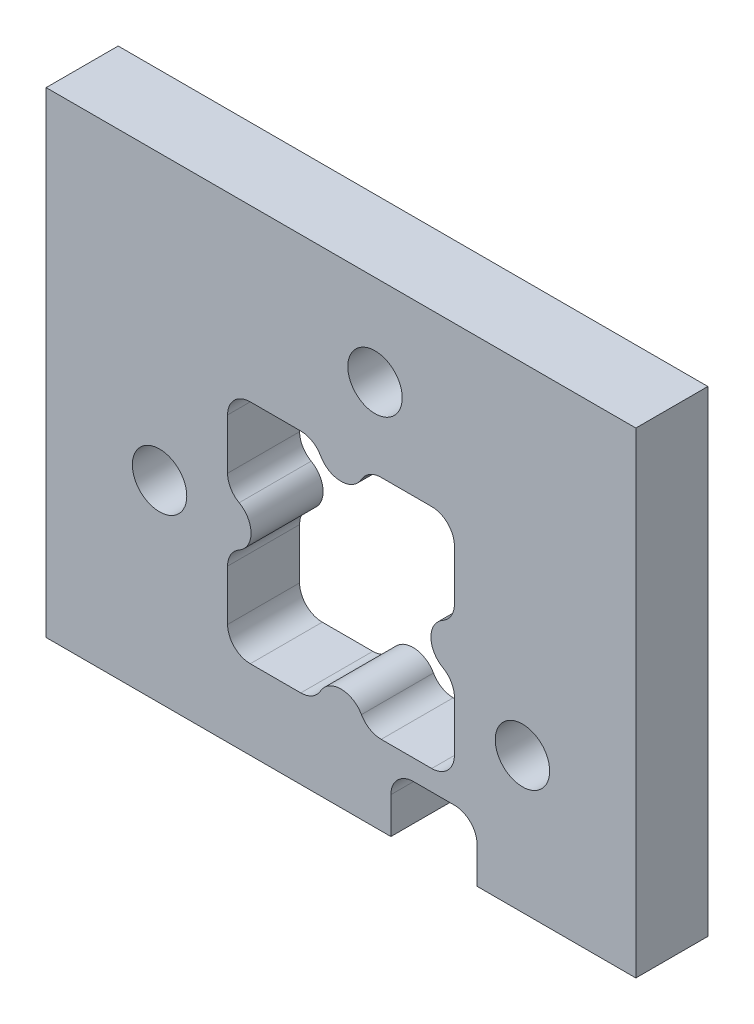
ISO-10303-21;
HEADER;
FILE_DESCRIPTION(('STEP AP214'),'2;1');
FILE_NAME('part.step','',(''),(''),'','','');
FILE_SCHEMA(('AUTOMOTIVE_DESIGN { 1 0 10303 214 1 1 1 1 }'));
ENDSEC;
DATA;
#1=APPLICATION_CONTEXT('core data for automotive mechanical design processes');
#2=APPLICATION_PROTOCOL_DEFINITION('international standard','automotive_design',2000,#1);
#3=PRODUCT_CONTEXT('',#1,'mechanical');
#4=PRODUCT('Part','Part','',(#3));
#5=PRODUCT_RELATED_PRODUCT_CATEGORY('part','',(#4));
#6=PRODUCT_DEFINITION_FORMATION('','',#4);
#7=PRODUCT_DEFINITION_CONTEXT('part definition',#1,'design');
#8=PRODUCT_DEFINITION('design','',#6,#7);
#9=PRODUCT_DEFINITION_SHAPE('','',#8);
#10=(LENGTH_UNIT() NAMED_UNIT(*) SI_UNIT(.MILLI.,.METRE.));
#11=(NAMED_UNIT(*) PLANE_ANGLE_UNIT() SI_UNIT($,.RADIAN.));
#12=(NAMED_UNIT(*) SI_UNIT($,.STERADIAN.) SOLID_ANGLE_UNIT());
#13=UNCERTAINTY_MEASURE_WITH_UNIT(LENGTH_MEASURE(1.E-05),#10,'distance_accuracy_value','');
#14=(GEOMETRIC_REPRESENTATION_CONTEXT(3) GLOBAL_UNCERTAINTY_ASSIGNED_CONTEXT((#13)) GLOBAL_UNIT_ASSIGNED_CONTEXT((#10,
#11,#12)) REPRESENTATION_CONTEXT('',''));
#15=CARTESIAN_POINT('',(0.,0.,0.));
#16=DIRECTION('',(0.,0.,1.));
#17=DIRECTION('',(1.,0.,0.));
#18=AXIS2_PLACEMENT_3D('',#15,#16,#17);
#19=CARTESIAN_POINT('',(-13.783981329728,8.2438596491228,3.175));
#20=DIRECTION('',(1.,0.,0.));
#21=DIRECTION('',(0.,0.,-1.));
#22=AXIS2_PLACEMENT_3D('',#19,#20,#21);
#23=PLANE('',#22);
#24=DIRECTION('',(0.,-1.,0.));
#25=VECTOR('',#24,1.);
#26=CARTESIAN_POINT('',(-13.783981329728,8.2438596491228,0.));
#27=LINE('',#26,#25);
#28=CARTESIAN_POINT('',(-13.783981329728,8.2438596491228,0.));
#29=VERTEX_POINT('',#28);
#30=CARTESIAN_POINT('',(-13.783981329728,-12.7561403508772,0.));
#31=VERTEX_POINT('',#30);
#32=EDGE_CURVE('E276',#29,#31,#27,.T.);
#33=ORIENTED_EDGE('',*,*,#32,.T.);
#34=DIRECTION('',(0.,0.,-1.));
#35=VECTOR('',#34,1.);
#36=CARTESIAN_POINT('',(-13.783981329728,-12.7561403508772,3.175));
#37=LINE('',#36,#35);
#38=CARTESIAN_POINT('',(-13.783981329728,-12.7561403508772,3.175));
#39=VERTEX_POINT('',#38);
#40=EDGE_CURVE('E258',#39,#31,#37,.T.);
#41=ORIENTED_EDGE('',*,*,#40,.F.);
#42=DIRECTION('',(0.,-1.,0.));
#43=VECTOR('',#42,1.);
#44=CARTESIAN_POINT('',(-13.783981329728,8.2438596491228,3.175));
#45=LINE('',#44,#43);
#46=CARTESIAN_POINT('',(-13.783981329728,8.2438596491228,3.175));
#47=VERTEX_POINT('',#46);
#48=EDGE_CURVE('E264',#47,#39,#45,.T.);
#49=ORIENTED_EDGE('',*,*,#48,.F.);
#50=DIRECTION('',(0.,0.,-1.));
#51=VECTOR('',#50,1.);
#52=CARTESIAN_POINT('',(-13.783981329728,8.2438596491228,3.175));
#53=LINE('',#52,#51);
#54=EDGE_CURVE('E440',#47,#29,#53,.T.);
#55=ORIENTED_EDGE('',*,*,#54,.T.);
#56=EDGE_LOOP('',(#33,#41,#49,#55));
#57=FACE_BOUND('',#56,.T.);
#58=ADVANCED_FACE('F33',(#57),#23,.F.);
#59=CARTESIAN_POINT('',(-13.783981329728,-12.7561403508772,3.175));
#60=DIRECTION('',(0.,1.,0.));
#61=DIRECTION('',(-1.,0.,0.));
#62=AXIS2_PLACEMENT_3D('',#59,#60,#61);
#63=PLANE('',#62);
#64=DIRECTION('',(1.,0.,0.));
#65=VECTOR('',#64,1.);
#66=CARTESIAN_POINT('',(-13.783981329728,-12.7561403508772,0.));
#67=LINE('',#66,#65);
#68=CARTESIAN_POINT('',(1.41601867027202,-12.7561403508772,0.));
#69=VERTEX_POINT('',#68);
#70=EDGE_CURVE('E432',#31,#69,#67,.T.);
#71=ORIENTED_EDGE('',*,*,#70,.T.);
#72=DIRECTION('',(0.,0.,-1.));
#73=VECTOR('',#72,1.);
#74=CARTESIAN_POINT('',(1.41601867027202,-12.7561403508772,3.175));
#75=LINE('',#74,#73);
#76=CARTESIAN_POINT('',(1.41601867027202,-12.7561403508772,3.175));
#77=VERTEX_POINT('',#76);
#78=EDGE_CURVE('E261',#77,#69,#75,.T.);
#79=ORIENTED_EDGE('',*,*,#78,.F.);
#80=DIRECTION('',(1.,0.,0.));
#81=VECTOR('',#80,1.);
#82=CARTESIAN_POINT('',(-13.783981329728,-12.7561403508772,3.175));
#83=LINE('',#82,#81);
#84=EDGE_CURVE('E254',#39,#77,#83,.T.);
#85=ORIENTED_EDGE('',*,*,#84,.F.);
#86=ORIENTED_EDGE('',*,*,#40,.T.);
#87=EDGE_LOOP('',(#71,#79,#85,#86));
#88=FACE_BOUND('',#87,.T.);
#89=ADVANCED_FACE('F256',(#88),#63,.F.);
#90=CARTESIAN_POINT('',(1.41601867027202,-12.7561403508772,3.175));
#91=DIRECTION('',(-1.,0.,0.));
#92=DIRECTION('',(0.,0.,1.));
#93=AXIS2_PLACEMENT_3D('',#90,#91,#92);
#94=PLANE('',#93);
#95=DIRECTION('',(0.,1.,0.));
#96=VECTOR('',#95,1.);
#97=CARTESIAN_POINT('',(1.41601867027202,-12.7561403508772,0.));
#98=LINE('',#97,#96);
#99=CARTESIAN_POINT('',(1.41601867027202,-11.1561403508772,0.));
#100=VERTEX_POINT('',#99);
#101=EDGE_CURVE('E428',#69,#100,#98,.T.);
#102=ORIENTED_EDGE('',*,*,#101,.T.);
#103=DIRECTION('',(0.,0.,-1.));
#104=VECTOR('',#103,1.);
#105=CARTESIAN_POINT('',(1.41601867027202,-11.1561403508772,3.175));
#106=LINE('',#105,#104);
#107=CARTESIAN_POINT('',(1.41601867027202,-11.1561403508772,3.175));
#108=VERTEX_POINT('',#107);
#109=EDGE_CURVE('E48',#100,#108,#106,.F.);
#110=ORIENTED_EDGE('',*,*,#109,.T.);
#111=DIRECTION('',(0.,1.,0.));
#112=VECTOR('',#111,1.);
#113=CARTESIAN_POINT('',(1.41601867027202,-12.7561403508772,3.175));
#114=LINE('',#113,#112);
#115=EDGE_CURVE('E263',#77,#108,#114,.T.);
#116=ORIENTED_EDGE('',*,*,#115,.F.);
#117=ORIENTED_EDGE('',*,*,#78,.T.);
#118=EDGE_LOOP('',(#102,#110,#116,#117));
#119=FACE_BOUND('',#118,.T.);
#120=ADVANCED_FACE('F464',(#119),#94,.F.);
#121=CARTESIAN_POINT('',(1.41601867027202,-10.1561403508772,3.175));
#122=DIRECTION('',(0.,1.,0.));
#123=DIRECTION('',(0.,0.,1.));
#124=AXIS2_PLACEMENT_3D('',#121,#122,#123);
#125=PLANE('',#124);
#126=DIRECTION('',(1.,0.,0.));
#127=VECTOR('',#126,1.);
#128=CARTESIAN_POINT('',(1.41601867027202,-10.1561403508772,0.));
#129=LINE('',#128,#127);
#130=CARTESIAN_POINT('',(2.41601867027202,-10.1561403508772,0.));
#131=VERTEX_POINT('',#130);
#132=CARTESIAN_POINT('',(4.21601867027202,-10.1561403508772,0.));
#133=VERTEX_POINT('',#132);
#134=EDGE_CURVE('E422',#131,#133,#129,.T.);
#135=ORIENTED_EDGE('',*,*,#134,.T.);
#136=DIRECTION('',(0.,0.,-1.));
#137=VECTOR('',#136,1.);
#138=CARTESIAN_POINT('',(4.21601867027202,-10.1561403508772,3.175));
#139=LINE('',#138,#137);
#140=CARTESIAN_POINT('',(4.21601867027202,-10.1561403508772,3.175));
#141=VERTEX_POINT('',#140);
#142=EDGE_CURVE('E396',#133,#141,#139,.F.);
#143=ORIENTED_EDGE('',*,*,#142,.T.);
#144=DIRECTION('',(1.,0.,0.));
#145=VECTOR('',#144,1.);
#146=CARTESIAN_POINT('',(1.41601867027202,-10.1561403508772,3.175));
#147=LINE('',#146,#145);
#148=CARTESIAN_POINT('',(2.41601867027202,-10.1561403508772,3.175));
#149=VERTEX_POINT('',#148);
#150=EDGE_CURVE('E408',#149,#141,#147,.T.);
#151=ORIENTED_EDGE('',*,*,#150,.F.);
#152=DIRECTION('',(0.,0.,-1.));
#153=VECTOR('',#152,1.);
#154=CARTESIAN_POINT('',(2.41601867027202,-10.1561403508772,0.));
#155=LINE('',#154,#153);
#156=EDGE_CURVE('E393',#149,#131,#155,.T.);
#157=ORIENTED_EDGE('',*,*,#156,.T.);
#158=EDGE_LOOP('',(#135,#143,#151,#157));
#159=FACE_BOUND('',#158,.T.);
#160=ADVANCED_FACE('F426',(#159),#125,.F.);
#161=CARTESIAN_POINT('',(5.21601867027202,-10.1561403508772,3.175));
#162=DIRECTION('',(1.,0.,0.));
#163=DIRECTION('',(0.,0.,-1.));
#164=AXIS2_PLACEMENT_3D('',#161,#162,#163);
#165=PLANE('',#164);
#166=DIRECTION('',(0.,-1.,0.));
#167=VECTOR('',#166,1.);
#168=CARTESIAN_POINT('',(5.21601867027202,-10.1561403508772,3.175));
#169=LINE('',#168,#167);
#170=CARTESIAN_POINT('',(5.21601867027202,-11.1561403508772,3.175));
#171=VERTEX_POINT('',#170);
#172=CARTESIAN_POINT('',(5.21601867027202,-12.7561403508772,3.175));
#173=VERTEX_POINT('',#172);
#174=EDGE_CURVE('E405',#171,#173,#169,.T.);
#175=ORIENTED_EDGE('',*,*,#174,.F.);
#176=DIRECTION('',(0.,0.,-1.));
#177=VECTOR('',#176,1.);
#178=CARTESIAN_POINT('',(5.21601867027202,-11.1561403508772,0.));
#179=LINE('',#178,#177);
#180=CARTESIAN_POINT('',(5.21601867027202,-11.1561403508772,0.));
#181=VERTEX_POINT('',#180);
#182=EDGE_CURVE('E390',#171,#181,#179,.T.);
#183=ORIENTED_EDGE('',*,*,#182,.T.);
#184=DIRECTION('',(0.,-1.,0.));
#185=VECTOR('',#184,1.);
#186=CARTESIAN_POINT('',(5.21601867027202,-10.1561403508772,0.));
#187=LINE('',#186,#185);
#188=CARTESIAN_POINT('',(5.21601867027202,-12.7561403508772,0.));
#189=VERTEX_POINT('',#188);
#190=EDGE_CURVE('E424',#181,#189,#187,.T.);
#191=ORIENTED_EDGE('',*,*,#190,.T.);
#192=DIRECTION('',(0.,0.,-1.));
#193=VECTOR('',#192,1.);
#194=CARTESIAN_POINT('',(5.21601867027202,-12.7561403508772,3.175));
#195=LINE('',#194,#193);
#196=EDGE_CURVE('E281',#173,#189,#195,.T.);
#197=ORIENTED_EDGE('',*,*,#196,.F.);
#198=EDGE_LOOP('',(#175,#183,#191,#197));
#199=FACE_BOUND('',#198,.T.);
#200=ADVANCED_FACE('F413',(#199),#165,.F.);
#201=CARTESIAN_POINT('',(5.21601867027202,-12.7561403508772,3.175));
#202=DIRECTION('',(0.,1.,0.));
#203=DIRECTION('',(0.,0.,1.));
#204=AXIS2_PLACEMENT_3D('',#201,#202,#203);
#205=PLANE('',#204);
#206=DIRECTION('',(1.,0.,0.));
#207=VECTOR('',#206,1.);
#208=CARTESIAN_POINT('',(5.21601867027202,-12.7561403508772,0.));
#209=LINE('',#208,#207);
#210=CARTESIAN_POINT('',(12.216018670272,-12.7561403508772,0.));
#211=VERTEX_POINT('',#210);
#212=EDGE_CURVE('E430',#189,#211,#209,.T.);
#213=ORIENTED_EDGE('',*,*,#212,.T.);
#214=DIRECTION('',(0.,0.,-1.));
#215=VECTOR('',#214,1.);
#216=CARTESIAN_POINT('',(12.216018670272,-12.7561403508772,3.175));
#217=LINE('',#216,#215);
#218=CARTESIAN_POINT('',(12.216018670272,-12.7561403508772,3.175));
#219=VERTEX_POINT('',#218);
#220=EDGE_CURVE('E445',#219,#211,#217,.T.);
#221=ORIENTED_EDGE('',*,*,#220,.F.);
#222=DIRECTION('',(1.,0.,0.));
#223=VECTOR('',#222,1.);
#224=CARTESIAN_POINT('',(5.21601867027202,-12.7561403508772,3.175));
#225=LINE('',#224,#223);
#226=EDGE_CURVE('E417',#173,#219,#225,.T.);
#227=ORIENTED_EDGE('',*,*,#226,.F.);
#228=ORIENTED_EDGE('',*,*,#196,.T.);
#229=EDGE_LOOP('',(#213,#221,#227,#228));
#230=FACE_BOUND('',#229,.T.);
#231=ADVANCED_FACE('F448',(#230),#205,.F.);
#232=CARTESIAN_POINT('',(12.216018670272,8.2438596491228,3.175));
#233=DIRECTION('',(-1.,0.,0.));
#234=DIRECTION('',(0.,-1.,0.));
#235=AXIS2_PLACEMENT_3D('',#232,#233,#234);
#236=PLANE('',#235);
#237=DIRECTION('',(0.,1.,0.));
#238=VECTOR('',#237,1.);
#239=CARTESIAN_POINT('',(12.216018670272,8.2438596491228,0.));
#240=LINE('',#239,#238);
#241=CARTESIAN_POINT('',(12.216018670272,8.2438596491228,0.));
#242=VERTEX_POINT('',#241);
#243=EDGE_CURVE('E437',#211,#242,#240,.T.);
#244=ORIENTED_EDGE('',*,*,#243,.T.);
#245=DIRECTION('',(0.,0.,-1.));
#246=VECTOR('',#245,1.);
#247=CARTESIAN_POINT('',(12.216018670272,8.2438596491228,3.175));
#248=LINE('',#247,#246);
#249=CARTESIAN_POINT('',(12.216018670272,8.2438596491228,3.175));
#250=VERTEX_POINT('',#249);
#251=EDGE_CURVE('E442',#250,#242,#248,.T.);
#252=ORIENTED_EDGE('',*,*,#251,.F.);
#253=DIRECTION('',(0.,1.,0.));
#254=VECTOR('',#253,1.);
#255=CARTESIAN_POINT('',(12.216018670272,8.2438596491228,3.175));
#256=LINE('',#255,#254);
#257=EDGE_CURVE('E458',#219,#250,#256,.T.);
#258=ORIENTED_EDGE('',*,*,#257,.F.);
#259=ORIENTED_EDGE('',*,*,#220,.T.);
#260=EDGE_LOOP('',(#244,#252,#258,#259));
#261=FACE_BOUND('',#260,.T.);
#262=ADVANCED_FACE('F454',(#261),#236,.F.);
#263=CARTESIAN_POINT('',(-13.783981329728,8.2438596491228,3.175));
#264=DIRECTION('',(0.,-1.,0.));
#265=DIRECTION('',(0.,0.,-1.));
#266=AXIS2_PLACEMENT_3D('',#263,#264,#265);
#267=PLANE('',#266);
#268=DIRECTION('',(-1.,0.,0.));
#269=VECTOR('',#268,1.);
#270=CARTESIAN_POINT('',(-13.783981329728,8.2438596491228,0.));
#271=LINE('',#270,#269);
#272=EDGE_CURVE('E273',#242,#29,#271,.T.);
#273=ORIENTED_EDGE('',*,*,#272,.T.);
#274=ORIENTED_EDGE('',*,*,#54,.F.);
#275=DIRECTION('',(-1.,0.,0.));
#276=VECTOR('',#275,1.);
#277=CARTESIAN_POINT('',(-13.783981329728,8.2438596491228,3.175));
#278=LINE('',#277,#276);
#279=EDGE_CURVE('E269',#250,#47,#278,.T.);
#280=ORIENTED_EDGE('',*,*,#279,.F.);
#281=ORIENTED_EDGE('',*,*,#251,.T.);
#282=EDGE_LOOP('',(#273,#274,#280,#281));
#283=FACE_BOUND('',#282,.T.);
#284=ADVANCED_FACE('F457',(#283),#267,.F.);
#285=CARTESIAN_POINT('',(0.,0.,3.175));
#286=DIRECTION('',(0.,0.,1.));
#287=DIRECTION('',(1.,0.,0.));
#288=AXIS2_PLACEMENT_3D('',#285,#286,#287);
#289=PLANE('',#288);
#290=CARTESIAN_POINT('',(-8.78398132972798,-4.2561403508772,3.175));
#291=DIRECTION('',(0.,0.,1.));
#292=DIRECTION('',(1.,0.,0.));
#293=AXIS2_PLACEMENT_3D('',#290,#291,#292);
#294=CIRCLE('',#293,1.2);
#295=CARTESIAN_POINT('',(-7.58398132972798,-4.2561403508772,3.175));
#296=VERTEX_POINT('',#295);
#297=EDGE_CURVE('E553',#296,#296,#294,.T.);
#298=ORIENTED_EDGE('',*,*,#297,.F.);
#299=EDGE_LOOP('',(#298));
#300=FACE_BOUND('',#299,.T.);
#301=CARTESIAN_POINT('',(0.716018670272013,4.2438596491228,3.175));
#302=DIRECTION('',(0.,0.,1.));
#303=DIRECTION('',(1.,0.,0.));
#304=AXIS2_PLACEMENT_3D('',#301,#302,#303);
#305=CIRCLE('',#304,1.2);
#306=CARTESIAN_POINT('',(1.91601867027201,4.2438596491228,3.175));
#307=VERTEX_POINT('',#306);
#308=EDGE_CURVE('E547',#307,#307,#305,.T.);
#309=ORIENTED_EDGE('',*,*,#308,.F.);
#310=EDGE_LOOP('',(#309));
#311=FACE_BOUND('',#310,.T.);
#312=CARTESIAN_POINT('',(7.21601867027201,-6.7561403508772,3.175));
#313=DIRECTION('',(0.,0.,1.));
#314=DIRECTION('',(1.,0.,0.));
#315=AXIS2_PLACEMENT_3D('',#312,#313,#314);
#316=CIRCLE('',#315,1.20000000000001);
#317=CARTESIAN_POINT('',(8.41601867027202,-6.7561403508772,3.175));
#318=VERTEX_POINT('',#317);
#319=EDGE_CURVE('E541',#318,#318,#316,.T.);
#320=ORIENTED_EDGE('',*,*,#319,.F.);
#321=EDGE_LOOP('',(#320));
#322=FACE_BOUND('',#321,.T.);
#323=DIRECTION('',(0.,1.,0.));
#324=VECTOR('',#323,1.);
#325=CARTESIAN_POINT('',(4.21601867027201,0.743859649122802,3.175));
#326=LINE('',#325,#324);
#327=CARTESIAN_POINT('',(4.21601867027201,-2.48317721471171,3.175));
#328=VERTEX_POINT('',#327);
#329=CARTESIAN_POINT('',(4.21601867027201,-0.256140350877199,3.175));
#330=VERTEX_POINT('',#329);
#331=EDGE_CURVE('E503',#328,#330,#326,.T.);
#332=ORIENTED_EDGE('',*,*,#331,.F.);
#333=CARTESIAN_POINT('',(3.21601867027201,-2.4831772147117,3.175));
#334=DIRECTION('',(0.,0.,1.));
#335=DIRECTION('',(1.,0.,0.));
#336=AXIS2_PLACEMENT_3D('',#333,#334,#335);
#337=CIRCLE('',#336,1.);
#338=CARTESIAN_POINT('',(3.70729027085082,-3.35418365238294,3.175));
#339=VERTEX_POINT('',#338);
#340=EDGE_CURVE('E342',#328,#339,#337,.F.);
#341=ORIENTED_EDGE('',*,*,#340,.T.);
#342=CARTESIAN_POINT('',(4.21601867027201,-4.2561403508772,3.175));
#343=DIRECTION('',(0.,0.,-1.));
#344=DIRECTION('',(-1.,0.,0.));
#345=AXIS2_PLACEMENT_3D('',#342,#343,#344);
#346=CIRCLE('',#345,1.03553390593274);
#347=CARTESIAN_POINT('',(3.70729027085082,-5.15809704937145,3.175));
#348=VERTEX_POINT('',#347);
#349=EDGE_CURVE('E469',#348,#339,#346,.T.);
#350=ORIENTED_EDGE('',*,*,#349,.F.);
#351=CARTESIAN_POINT('',(3.21601867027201,-6.02910348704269,3.175));
#352=DIRECTION('',(0.,0.,1.));
#353=DIRECTION('',(1.,0.,0.));
#354=AXIS2_PLACEMENT_3D('',#351,#352,#353);
#355=CIRCLE('',#354,1.);
#356=CARTESIAN_POINT('',(4.21601867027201,-6.02910348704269,3.175));
#357=VERTEX_POINT('',#356);
#358=EDGE_CURVE('E346',#348,#357,#355,.F.);
#359=ORIENTED_EDGE('',*,*,#358,.T.);
#360=DIRECTION('',(0.,1.,0.));
#361=VECTOR('',#360,1.);
#362=CARTESIAN_POINT('',(4.21601867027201,-5.29167425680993,3.175));
#363=LINE('',#362,#361);
#364=CARTESIAN_POINT('',(4.21601867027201,-8.2561403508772,3.175));
#365=VERTEX_POINT('',#364);
#366=EDGE_CURVE('E473',#365,#357,#363,.T.);
#367=ORIENTED_EDGE('',*,*,#366,.F.);
#368=CARTESIAN_POINT('',(3.21601867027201,-8.2561403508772,3.175));
#369=DIRECTION('',(0.,0.,1.));
#370=DIRECTION('',(1.,0.,0.));
#371=AXIS2_PLACEMENT_3D('',#368,#369,#370);
#372=CIRCLE('',#371,1.);
#373=CARTESIAN_POINT('',(3.21601867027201,-9.2561403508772,3.175));
#374=VERTEX_POINT('',#373);
#375=EDGE_CURVE('E350',#365,#374,#372,.F.);
#376=ORIENTED_EDGE('',*,*,#375,.T.);
#377=DIRECTION('',(1.,0.,0.));
#378=VECTOR('',#377,1.);
#379=CARTESIAN_POINT('',(4.21601867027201,-9.2561403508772,3.175));
#380=LINE('',#379,#378);
#381=CARTESIAN_POINT('',(0.98898180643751,-9.2561403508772,3.175));
#382=VERTEX_POINT('',#381);
#383=EDGE_CURVE('E476',#382,#374,#380,.T.);
#384=ORIENTED_EDGE('',*,*,#383,.F.);
#385=CARTESIAN_POINT('',(0.988981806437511,-8.2561403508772,3.175));
#386=DIRECTION('',(0.,0.,1.));
#387=DIRECTION('',(1.,0.,0.));
#388=AXIS2_PLACEMENT_3D('',#385,#386,#387);
#389=CIRCLE('',#388,1.);
#390=CARTESIAN_POINT('',(0.117975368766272,-8.747411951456,3.175));
#391=VERTEX_POINT('',#390);
#392=EDGE_CURVE('E354',#382,#391,#389,.F.);
#393=ORIENTED_EDGE('',*,*,#392,.T.);
#394=CARTESIAN_POINT('',(-0.783981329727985,-9.2561403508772,3.175));
#395=DIRECTION('',(0.,0.,-1.));
#396=DIRECTION('',(-1.,0.,0.));
#397=AXIS2_PLACEMENT_3D('',#394,#395,#396);
#398=CIRCLE('',#397,1.03553390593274);
#399=CARTESIAN_POINT('',(-1.68593802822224,-8.747411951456,3.175));
#400=VERTEX_POINT('',#399);
#401=EDGE_CURVE('E479',#400,#391,#398,.T.);
#402=ORIENTED_EDGE('',*,*,#401,.F.);
#403=CARTESIAN_POINT('',(-2.55694446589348,-8.2561403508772,3.175));
#404=DIRECTION('',(0.,0.,1.));
#405=DIRECTION('',(1.,0.,0.));
#406=AXIS2_PLACEMENT_3D('',#403,#404,#405);
#407=CIRCLE('',#406,1.);
#408=CARTESIAN_POINT('',(-2.55694446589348,-9.2561403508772,3.175));
#409=VERTEX_POINT('',#408);
#410=EDGE_CURVE('E358',#400,#409,#407,.F.);
#411=ORIENTED_EDGE('',*,*,#410,.T.);
#412=DIRECTION('',(1.,0.,0.));
#413=VECTOR('',#412,1.);
#414=CARTESIAN_POINT('',(-1.81951523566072,-9.2561403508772,3.175));
#415=LINE('',#414,#413);
#416=CARTESIAN_POINT('',(-4.78398132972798,-9.2561403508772,3.175));
#417=VERTEX_POINT('',#416);
#418=EDGE_CURVE('E482',#417,#409,#415,.T.);
#419=ORIENTED_EDGE('',*,*,#418,.F.);
#420=CARTESIAN_POINT('',(-4.78398132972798,-8.2561403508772,3.175));
#421=DIRECTION('',(0.,0.,1.));
#422=DIRECTION('',(1.,0.,0.));
#423=AXIS2_PLACEMENT_3D('',#420,#421,#422);
#424=CIRCLE('',#423,1.);
#425=CARTESIAN_POINT('',(-5.78398132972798,-8.2561403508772,3.175));
#426=VERTEX_POINT('',#425);
#427=EDGE_CURVE('E362',#417,#426,#424,.F.);
#428=ORIENTED_EDGE('',*,*,#427,.T.);
#429=DIRECTION('',(0.,-1.,0.));
#430=VECTOR('',#429,1.);
#431=CARTESIAN_POINT('',(-5.78398132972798,-9.2561403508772,3.175));
#432=LINE('',#431,#430);
#433=CARTESIAN_POINT('',(-5.78398132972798,-6.02910348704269,3.175));
#434=VERTEX_POINT('',#433);
#435=EDGE_CURVE('E485',#434,#426,#432,.T.);
#436=ORIENTED_EDGE('',*,*,#435,.F.);
#437=CARTESIAN_POINT('',(-4.78398132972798,-6.02910348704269,3.175));
#438=DIRECTION('',(0.,0.,1.));
#439=DIRECTION('',(1.,0.,0.));
#440=AXIS2_PLACEMENT_3D('',#437,#438,#439);
#441=CIRCLE('',#440,1.);
#442=CARTESIAN_POINT('',(-5.27525293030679,-5.15809704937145,3.175));
#443=VERTEX_POINT('',#442);
#444=EDGE_CURVE('E366',#434,#443,#441,.F.);
#445=ORIENTED_EDGE('',*,*,#444,.T.);
#446=CARTESIAN_POINT('',(-5.78398132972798,-4.2561403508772,3.175));
#447=DIRECTION('',(0.,0.,-1.));
#448=DIRECTION('',(-1.,0.,0.));
#449=AXIS2_PLACEMENT_3D('',#446,#447,#448);
#450=CIRCLE('',#449,1.03553390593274);
#451=CARTESIAN_POINT('',(-5.27525293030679,-3.35418365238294,3.175));
#452=VERTEX_POINT('',#451);
#453=EDGE_CURVE('E488',#452,#443,#450,.T.);
#454=ORIENTED_EDGE('',*,*,#453,.F.);
#455=CARTESIAN_POINT('',(-4.78398132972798,-2.4831772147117,3.175));
#456=DIRECTION('',(0.,0.,1.));
#457=DIRECTION('',(1.,0.,0.));
#458=AXIS2_PLACEMENT_3D('',#455,#456,#457);
#459=CIRCLE('',#458,1.);
#460=CARTESIAN_POINT('',(-5.78398132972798,-2.48317721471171,3.175));
#461=VERTEX_POINT('',#460);
#462=EDGE_CURVE('E370',#452,#461,#459,.F.);
#463=ORIENTED_EDGE('',*,*,#462,.T.);
#464=DIRECTION('',(0.,-1.,0.));
#465=VECTOR('',#464,1.);
#466=CARTESIAN_POINT('',(-5.78398132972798,-3.22060644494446,3.175));
#467=LINE('',#466,#465);
#468=CARTESIAN_POINT('',(-5.78398132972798,-0.256140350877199,3.175));
#469=VERTEX_POINT('',#468);
#470=EDGE_CURVE('E491',#469,#461,#467,.T.);
#471=ORIENTED_EDGE('',*,*,#470,.F.);
#472=CARTESIAN_POINT('',(-4.78398132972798,-0.256140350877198,3.175));
#473=DIRECTION('',(0.,0.,1.));
#474=DIRECTION('',(1.,0.,0.));
#475=AXIS2_PLACEMENT_3D('',#472,#473,#474);
#476=CIRCLE('',#475,1.);
#477=CARTESIAN_POINT('',(-4.78398132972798,0.743859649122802,3.175));
#478=VERTEX_POINT('',#477);
#479=EDGE_CURVE('E374',#469,#478,#476,.F.);
#480=ORIENTED_EDGE('',*,*,#479,.T.);
#481=DIRECTION('',(-1.,0.,0.));
#482=VECTOR('',#481,1.);
#483=CARTESIAN_POINT('',(-5.78398132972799,0.743859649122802,3.175));
#484=LINE('',#483,#482);
#485=CARTESIAN_POINT('',(-2.55694446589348,0.743859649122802,3.175));
#486=VERTEX_POINT('',#485);
#487=EDGE_CURVE('E494',#486,#478,#484,.T.);
#488=ORIENTED_EDGE('',*,*,#487,.F.);
#489=CARTESIAN_POINT('',(-2.55694446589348,-0.256140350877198,3.175));
#490=DIRECTION('',(0.,0.,1.));
#491=DIRECTION('',(1.,0.,0.));
#492=AXIS2_PLACEMENT_3D('',#489,#490,#491);
#493=CIRCLE('',#492,1.);
#494=CARTESIAN_POINT('',(-1.68593802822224,0.235131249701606,3.175));
#495=VERTEX_POINT('',#494);
#496=EDGE_CURVE('E378',#486,#495,#493,.F.);
#497=ORIENTED_EDGE('',*,*,#496,.T.);
#498=CARTESIAN_POINT('',(-0.783981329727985,0.743859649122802,3.175));
#499=DIRECTION('',(0.,0.,-1.));
#500=DIRECTION('',(-1.,0.,0.));
#501=AXIS2_PLACEMENT_3D('',#498,#499,#500);
#502=CIRCLE('',#501,1.03553390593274);
#503=CARTESIAN_POINT('',(0.11797536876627,0.235131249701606,3.175));
#504=VERTEX_POINT('',#503);
#505=EDGE_CURVE('E497',#504,#495,#502,.T.);
#506=ORIENTED_EDGE('',*,*,#505,.F.);
#507=CARTESIAN_POINT('',(0.988981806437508,-0.256140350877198,3.175));
#508=DIRECTION('',(0.,0.,1.));
#509=DIRECTION('',(1.,0.,0.));
#510=AXIS2_PLACEMENT_3D('',#507,#508,#509);
#511=CIRCLE('',#510,1.);
#512=CARTESIAN_POINT('',(0.988981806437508,0.743859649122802,3.175));
#513=VERTEX_POINT('',#512);
#514=EDGE_CURVE('E382',#504,#513,#511,.F.);
#515=ORIENTED_EDGE('',*,*,#514,.T.);
#516=DIRECTION('',(-1.,0.,0.));
#517=VECTOR('',#516,1.);
#518=CARTESIAN_POINT('',(0.251552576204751,0.743859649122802,3.175));
#519=LINE('',#518,#517);
#520=CARTESIAN_POINT('',(3.21601867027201,0.743859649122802,3.175));
#521=VERTEX_POINT('',#520);
#522=EDGE_CURVE('E500',#521,#513,#519,.T.);
#523=ORIENTED_EDGE('',*,*,#522,.F.);
#524=CARTESIAN_POINT('',(3.21601867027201,-0.256140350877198,3.175));
#525=DIRECTION('',(0.,0.,1.));
#526=DIRECTION('',(1.,0.,0.));
#527=AXIS2_PLACEMENT_3D('',#524,#525,#526);
#528=CIRCLE('',#527,1.);
#529=EDGE_CURVE('E386',#521,#330,#528,.F.);
#530=ORIENTED_EDGE('',*,*,#529,.T.);
#531=EDGE_LOOP('',(#332,#341,#350,#359,#367,#376,#384,#393,#402,#411,#419,#428,#436,#445,#454,
#463,#471,#480,#488,#497,#506,#515,#523,#530));
#532=FACE_BOUND('',#531,.T.);
#533=ORIENTED_EDGE('',*,*,#48,.T.);
#534=ORIENTED_EDGE('',*,*,#84,.T.);
#535=ORIENTED_EDGE('',*,*,#115,.T.);
#536=CARTESIAN_POINT('',(2.41601867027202,-11.1561403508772,3.175));
#537=DIRECTION('',(0.,0.,1.));
#538=DIRECTION('',(1.,0.,0.));
#539=AXIS2_PLACEMENT_3D('',#536,#537,#538);
#540=CIRCLE('',#539,1.);
#541=EDGE_CURVE('E11',#108,#149,#540,.F.);
#542=ORIENTED_EDGE('',*,*,#541,.T.);
#543=ORIENTED_EDGE('',*,*,#150,.T.);
#544=CARTESIAN_POINT('',(4.21601867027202,-11.1561403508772,3.175));
#545=DIRECTION('',(0.,0.,1.));
#546=DIRECTION('',(1.,0.,0.));
#547=AXIS2_PLACEMENT_3D('',#544,#545,#546);
#548=CIRCLE('',#547,1.);
#549=EDGE_CURVE('E401',#141,#171,#548,.F.);
#550=ORIENTED_EDGE('',*,*,#549,.T.);
#551=ORIENTED_EDGE('',*,*,#174,.T.);
#552=ORIENTED_EDGE('',*,*,#226,.T.);
#553=ORIENTED_EDGE('',*,*,#257,.T.);
#554=ORIENTED_EDGE('',*,*,#279,.T.);
#555=EDGE_LOOP('',(#533,#534,#535,#542,#543,#550,#551,#552,#553,#554));
#556=FACE_BOUND('',#555,.T.);
#557=ADVANCED_FACE('F267',(#300,#311,#322,#532,#556),#289,.T.);
#558=CARTESIAN_POINT('',(0.,0.,0.));
#559=DIRECTION('',(0.,0.,1.));
#560=DIRECTION('',(1.,0.,0.));
#561=AXIS2_PLACEMENT_3D('',#558,#559,#560);
#562=PLANE('',#561);
#563=CARTESIAN_POINT('',(-8.78398132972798,-4.2561403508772,0.));
#564=DIRECTION('',(0.,0.,1.));
#565=DIRECTION('',(1.,0.,0.));
#566=AXIS2_PLACEMENT_3D('',#563,#564,#565);
#567=CIRCLE('',#566,1.2);
#568=CARTESIAN_POINT('',(-7.58398132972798,-4.2561403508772,0.));
#569=VERTEX_POINT('',#568);
#570=EDGE_CURVE('E550',#569,#569,#567,.T.);
#571=ORIENTED_EDGE('',*,*,#570,.T.);
#572=EDGE_LOOP('',(#571));
#573=FACE_BOUND('',#572,.T.);
#574=CARTESIAN_POINT('',(0.716018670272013,4.2438596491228,0.));
#575=DIRECTION('',(0.,0.,1.));
#576=DIRECTION('',(1.,0.,0.));
#577=AXIS2_PLACEMENT_3D('',#574,#575,#576);
#578=CIRCLE('',#577,1.2);
#579=CARTESIAN_POINT('',(1.91601867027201,4.2438596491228,0.));
#580=VERTEX_POINT('',#579);
#581=EDGE_CURVE('E544',#580,#580,#578,.T.);
#582=ORIENTED_EDGE('',*,*,#581,.T.);
#583=EDGE_LOOP('',(#582));
#584=FACE_BOUND('',#583,.T.);
#585=CARTESIAN_POINT('',(7.21601867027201,-6.7561403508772,0.));
#586=DIRECTION('',(0.,0.,1.));
#587=DIRECTION('',(1.,0.,0.));
#588=AXIS2_PLACEMENT_3D('',#585,#586,#587);
#589=CIRCLE('',#588,1.20000000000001);
#590=CARTESIAN_POINT('',(8.41601867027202,-6.7561403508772,0.));
#591=VERTEX_POINT('',#590);
#592=EDGE_CURVE('E506',#591,#591,#589,.T.);
#593=ORIENTED_EDGE('',*,*,#592,.T.);
#594=EDGE_LOOP('',(#593));
#595=FACE_BOUND('',#594,.T.);
#596=DIRECTION('',(0.,1.,0.));
#597=VECTOR('',#596,1.);
#598=CARTESIAN_POINT('',(4.21601867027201,-5.29167425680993,0.));
#599=LINE('',#598,#597);
#600=CARTESIAN_POINT('',(4.21601867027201,-8.2561403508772,0.));
#601=VERTEX_POINT('',#600);
#602=CARTESIAN_POINT('',(4.21601867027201,-6.02910348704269,0.));
#603=VERTEX_POINT('',#602);
#604=EDGE_CURVE('E509',#601,#603,#599,.T.);
#605=ORIENTED_EDGE('',*,*,#604,.T.);
#606=CARTESIAN_POINT('',(3.21601867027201,-6.02910348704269,0.));
#607=DIRECTION('',(0.,0.,1.));
#608=DIRECTION('',(1.,0.,0.));
#609=AXIS2_PLACEMENT_3D('',#606,#607,#608);
#610=CIRCLE('',#609,1.);
#611=CARTESIAN_POINT('',(3.70729027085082,-5.15809704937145,0.));
#612=VERTEX_POINT('',#611);
#613=EDGE_CURVE('E348',#603,#612,#610,.T.);
#614=ORIENTED_EDGE('',*,*,#613,.T.);
#615=CARTESIAN_POINT('',(4.21601867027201,-4.2561403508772,0.));
#616=DIRECTION('',(0.,0.,-1.));
#617=DIRECTION('',(-1.,0.,0.));
#618=AXIS2_PLACEMENT_3D('',#615,#616,#617);
#619=CIRCLE('',#618,1.03553390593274);
#620=CARTESIAN_POINT('',(3.70729027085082,-3.35418365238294,0.));
#621=VERTEX_POINT('',#620);
#622=EDGE_CURVE('E463',#612,#621,#619,.T.);
#623=ORIENTED_EDGE('',*,*,#622,.T.);
#624=CARTESIAN_POINT('',(3.21601867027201,-2.4831772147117,0.));
#625=DIRECTION('',(0.,0.,1.));
#626=DIRECTION('',(1.,0.,0.));
#627=AXIS2_PLACEMENT_3D('',#624,#625,#626);
#628=CIRCLE('',#627,1.);
#629=CARTESIAN_POINT('',(4.21601867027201,-2.48317721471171,0.));
#630=VERTEX_POINT('',#629);
#631=EDGE_CURVE('E344',#621,#630,#628,.T.);
#632=ORIENTED_EDGE('',*,*,#631,.T.);
#633=DIRECTION('',(0.,1.,0.));
#634=VECTOR('',#633,1.);
#635=CARTESIAN_POINT('',(4.21601867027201,0.743859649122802,0.));
#636=LINE('',#635,#634);
#637=CARTESIAN_POINT('',(4.21601867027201,-0.256140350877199,0.));
#638=VERTEX_POINT('',#637);
#639=EDGE_CURVE('E472',#630,#638,#636,.T.);
#640=ORIENTED_EDGE('',*,*,#639,.T.);
#641=CARTESIAN_POINT('',(3.21601867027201,-0.256140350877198,0.));
#642=DIRECTION('',(0.,0.,1.));
#643=DIRECTION('',(1.,0.,0.));
#644=AXIS2_PLACEMENT_3D('',#641,#642,#643);
#645=CIRCLE('',#644,1.);
#646=CARTESIAN_POINT('',(3.21601867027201,0.743859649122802,0.));
#647=VERTEX_POINT('',#646);
#648=EDGE_CURVE('E388',#638,#647,#645,.T.);
#649=ORIENTED_EDGE('',*,*,#648,.T.);
#650=DIRECTION('',(-1.,0.,0.));
#651=VECTOR('',#650,1.);
#652=CARTESIAN_POINT('',(0.251552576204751,0.743859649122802,0.));
#653=LINE('',#652,#651);
#654=CARTESIAN_POINT('',(0.988981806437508,0.743859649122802,0.));
#655=VERTEX_POINT('',#654);
#656=EDGE_CURVE('E536',#647,#655,#653,.T.);
#657=ORIENTED_EDGE('',*,*,#656,.T.);
#658=CARTESIAN_POINT('',(0.988981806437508,-0.256140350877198,0.));
#659=DIRECTION('',(0.,0.,1.));
#660=DIRECTION('',(1.,0.,0.));
#661=AXIS2_PLACEMENT_3D('',#658,#659,#660);
#662=CIRCLE('',#661,1.);
#663=CARTESIAN_POINT('',(0.11797536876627,0.235131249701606,0.));
#664=VERTEX_POINT('',#663);
#665=EDGE_CURVE('E384',#655,#664,#662,.T.);
#666=ORIENTED_EDGE('',*,*,#665,.T.);
#667=CARTESIAN_POINT('',(-0.783981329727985,0.743859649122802,0.));
#668=DIRECTION('',(0.,0.,-1.));
#669=DIRECTION('',(-1.,0.,0.));
#670=AXIS2_PLACEMENT_3D('',#667,#668,#669);
#671=CIRCLE('',#670,1.03553390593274);
#672=CARTESIAN_POINT('',(-1.68593802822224,0.235131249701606,0.));
#673=VERTEX_POINT('',#672);
#674=EDGE_CURVE('E533',#664,#673,#671,.T.);
#675=ORIENTED_EDGE('',*,*,#674,.T.);
#676=CARTESIAN_POINT('',(-2.55694446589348,-0.256140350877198,0.));
#677=DIRECTION('',(0.,0.,1.));
#678=DIRECTION('',(1.,0.,0.));
#679=AXIS2_PLACEMENT_3D('',#676,#677,#678);
#680=CIRCLE('',#679,1.);
#681=CARTESIAN_POINT('',(-2.55694446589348,0.743859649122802,0.));
#682=VERTEX_POINT('',#681);
#683=EDGE_CURVE('E380',#673,#682,#680,.T.);
#684=ORIENTED_EDGE('',*,*,#683,.T.);
#685=DIRECTION('',(-1.,0.,0.));
#686=VECTOR('',#685,1.);
#687=CARTESIAN_POINT('',(-5.78398132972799,0.743859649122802,0.));
#688=LINE('',#687,#686);
#689=CARTESIAN_POINT('',(-4.78398132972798,0.743859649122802,0.));
#690=VERTEX_POINT('',#689);
#691=EDGE_CURVE('E530',#682,#690,#688,.T.);
#692=ORIENTED_EDGE('',*,*,#691,.T.);
#693=CARTESIAN_POINT('',(-4.78398132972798,-0.256140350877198,0.));
#694=DIRECTION('',(0.,0.,1.));
#695=DIRECTION('',(1.,0.,0.));
#696=AXIS2_PLACEMENT_3D('',#693,#694,#695);
#697=CIRCLE('',#696,1.);
#698=CARTESIAN_POINT('',(-5.78398132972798,-0.256140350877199,0.));
#699=VERTEX_POINT('',#698);
#700=EDGE_CURVE('E376',#690,#699,#697,.T.);
#701=ORIENTED_EDGE('',*,*,#700,.T.);
#702=DIRECTION('',(0.,-1.,0.));
#703=VECTOR('',#702,1.);
#704=CARTESIAN_POINT('',(-5.78398132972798,-3.22060644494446,0.));
#705=LINE('',#704,#703);
#706=CARTESIAN_POINT('',(-5.78398132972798,-2.48317721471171,0.));
#707=VERTEX_POINT('',#706);
#708=EDGE_CURVE('E527',#699,#707,#705,.T.);
#709=ORIENTED_EDGE('',*,*,#708,.T.);
#710=CARTESIAN_POINT('',(-4.78398132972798,-2.4831772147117,0.));
#711=DIRECTION('',(0.,0.,1.));
#712=DIRECTION('',(1.,0.,0.));
#713=AXIS2_PLACEMENT_3D('',#710,#711,#712);
#714=CIRCLE('',#713,1.);
#715=CARTESIAN_POINT('',(-5.27525293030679,-3.35418365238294,0.));
#716=VERTEX_POINT('',#715);
#717=EDGE_CURVE('E372',#707,#716,#714,.T.);
#718=ORIENTED_EDGE('',*,*,#717,.T.);
#719=CARTESIAN_POINT('',(-5.78398132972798,-4.2561403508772,0.));
#720=DIRECTION('',(0.,0.,-1.));
#721=DIRECTION('',(-1.,0.,0.));
#722=AXIS2_PLACEMENT_3D('',#719,#720,#721);
#723=CIRCLE('',#722,1.03553390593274);
#724=CARTESIAN_POINT('',(-5.27525293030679,-5.15809704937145,0.));
#725=VERTEX_POINT('',#724);
#726=EDGE_CURVE('E524',#716,#725,#723,.T.);
#727=ORIENTED_EDGE('',*,*,#726,.T.);
#728=CARTESIAN_POINT('',(-4.78398132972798,-6.02910348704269,0.));
#729=DIRECTION('',(0.,0.,1.));
#730=DIRECTION('',(1.,0.,0.));
#731=AXIS2_PLACEMENT_3D('',#728,#729,#730);
#732=CIRCLE('',#731,1.);
#733=CARTESIAN_POINT('',(-5.78398132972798,-6.02910348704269,0.));
#734=VERTEX_POINT('',#733);
#735=EDGE_CURVE('E368',#725,#734,#732,.T.);
#736=ORIENTED_EDGE('',*,*,#735,.T.);
#737=DIRECTION('',(0.,-1.,0.));
#738=VECTOR('',#737,1.);
#739=CARTESIAN_POINT('',(-5.78398132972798,-9.2561403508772,0.));
#740=LINE('',#739,#738);
#741=CARTESIAN_POINT('',(-5.78398132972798,-8.2561403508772,0.));
#742=VERTEX_POINT('',#741);
#743=EDGE_CURVE('E521',#734,#742,#740,.T.);
#744=ORIENTED_EDGE('',*,*,#743,.T.);
#745=CARTESIAN_POINT('',(-4.78398132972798,-8.2561403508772,0.));
#746=DIRECTION('',(0.,0.,1.));
#747=DIRECTION('',(1.,0.,0.));
#748=AXIS2_PLACEMENT_3D('',#745,#746,#747);
#749=CIRCLE('',#748,1.);
#750=CARTESIAN_POINT('',(-4.78398132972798,-9.2561403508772,0.));
#751=VERTEX_POINT('',#750);
#752=EDGE_CURVE('E364',#742,#751,#749,.T.);
#753=ORIENTED_EDGE('',*,*,#752,.T.);
#754=DIRECTION('',(1.,0.,0.));
#755=VECTOR('',#754,1.);
#756=CARTESIAN_POINT('',(-1.81951523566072,-9.2561403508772,0.));
#757=LINE('',#756,#755);
#758=CARTESIAN_POINT('',(-2.55694446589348,-9.2561403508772,0.));
#759=VERTEX_POINT('',#758);
#760=EDGE_CURVE('E518',#751,#759,#757,.T.);
#761=ORIENTED_EDGE('',*,*,#760,.T.);
#762=CARTESIAN_POINT('',(-2.55694446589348,-8.2561403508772,0.));
#763=DIRECTION('',(0.,0.,1.));
#764=DIRECTION('',(1.,0.,0.));
#765=AXIS2_PLACEMENT_3D('',#762,#763,#764);
#766=CIRCLE('',#765,1.);
#767=CARTESIAN_POINT('',(-1.68593802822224,-8.747411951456,0.));
#768=VERTEX_POINT('',#767);
#769=EDGE_CURVE('E360',#759,#768,#766,.T.);
#770=ORIENTED_EDGE('',*,*,#769,.T.);
#771=CARTESIAN_POINT('',(-0.783981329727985,-9.2561403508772,0.));
#772=DIRECTION('',(0.,0.,-1.));
#773=DIRECTION('',(-1.,0.,0.));
#774=AXIS2_PLACEMENT_3D('',#771,#772,#773);
#775=CIRCLE('',#774,1.03553390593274);
#776=CARTESIAN_POINT('',(0.117975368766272,-8.747411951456,0.));
#777=VERTEX_POINT('',#776);
#778=EDGE_CURVE('E515',#768,#777,#775,.T.);
#779=ORIENTED_EDGE('',*,*,#778,.T.);
#780=CARTESIAN_POINT('',(0.988981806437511,-8.2561403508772,0.));
#781=DIRECTION('',(0.,0.,1.));
#782=DIRECTION('',(1.,0.,0.));
#783=AXIS2_PLACEMENT_3D('',#780,#781,#782);
#784=CIRCLE('',#783,1.);
#785=CARTESIAN_POINT('',(0.98898180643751,-9.2561403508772,0.));
#786=VERTEX_POINT('',#785);
#787=EDGE_CURVE('E356',#777,#786,#784,.T.);
#788=ORIENTED_EDGE('',*,*,#787,.T.);
#789=DIRECTION('',(1.,0.,0.));
#790=VECTOR('',#789,1.);
#791=CARTESIAN_POINT('',(4.21601867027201,-9.2561403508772,0.));
#792=LINE('',#791,#790);
#793=CARTESIAN_POINT('',(3.21601867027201,-9.2561403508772,0.));
#794=VERTEX_POINT('',#793);
#795=EDGE_CURVE('E512',#786,#794,#792,.T.);
#796=ORIENTED_EDGE('',*,*,#795,.T.);
#797=CARTESIAN_POINT('',(3.21601867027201,-8.2561403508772,0.));
#798=DIRECTION('',(0.,0.,1.));
#799=DIRECTION('',(1.,0.,0.));
#800=AXIS2_PLACEMENT_3D('',#797,#798,#799);
#801=CIRCLE('',#800,1.);
#802=EDGE_CURVE('E352',#794,#601,#801,.T.);
#803=ORIENTED_EDGE('',*,*,#802,.T.);
#804=EDGE_LOOP('',(#605,#614,#623,#632,#640,#649,#657,#666,#675,#684,#692,#701,#709,#718,#727,
#736,#744,#753,#761,#770,#779,#788,#796,#803));
#805=FACE_BOUND('',#804,.T.);
#806=ORIENTED_EDGE('',*,*,#32,.F.);
#807=ORIENTED_EDGE('',*,*,#272,.F.);
#808=ORIENTED_EDGE('',*,*,#243,.F.);
#809=ORIENTED_EDGE('',*,*,#212,.F.);
#810=ORIENTED_EDGE('',*,*,#190,.F.);
#811=CARTESIAN_POINT('',(4.21601867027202,-11.1561403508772,0.));
#812=DIRECTION('',(0.,0.,1.));
#813=DIRECTION('',(1.,0.,0.));
#814=AXIS2_PLACEMENT_3D('',#811,#812,#813);
#815=CIRCLE('',#814,1.);
#816=EDGE_CURVE('E399',#181,#133,#815,.T.);
#817=ORIENTED_EDGE('',*,*,#816,.T.);
#818=ORIENTED_EDGE('',*,*,#134,.F.);
#819=CARTESIAN_POINT('',(2.41601867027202,-11.1561403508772,0.));
#820=DIRECTION('',(0.,0.,1.));
#821=DIRECTION('',(1.,0.,0.));
#822=AXIS2_PLACEMENT_3D('',#819,#820,#821);
#823=CIRCLE('',#822,1.);
#824=EDGE_CURVE('E41',#131,#100,#823,.T.);
#825=ORIENTED_EDGE('',*,*,#824,.T.);
#826=ORIENTED_EDGE('',*,*,#101,.F.);
#827=ORIENTED_EDGE('',*,*,#70,.F.);
#828=EDGE_LOOP('',(#806,#807,#808,#809,#810,#817,#818,#825,#826,#827));
#829=FACE_BOUND('',#828,.T.);
#830=ADVANCED_FACE('F421',(#573,#584,#595,#805,#829),#562,.F.);
#831=CARTESIAN_POINT('',(4.21601867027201,0.743859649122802,0.));
#832=DIRECTION('',(1.,0.,0.));
#833=DIRECTION('',(0.,1.,0.));
#834=AXIS2_PLACEMENT_3D('',#831,#832,#833);
#835=PLANE('',#834);
#836=ORIENTED_EDGE('',*,*,#639,.F.);
#837=DIRECTION('',(0.,0.,-1.));
#838=VECTOR('',#837,1.);
#839=CARTESIAN_POINT('',(4.21601867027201,-2.48317721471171,3.175));
#840=LINE('',#839,#838);
#841=EDGE_CURVE('E279',#630,#328,#840,.F.);
#842=ORIENTED_EDGE('',*,*,#841,.T.);
#843=ORIENTED_EDGE('',*,*,#331,.T.);
#844=DIRECTION('',(0.,0.,1.));
#845=VECTOR('',#844,1.);
#846=CARTESIAN_POINT('',(4.21601867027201,-0.256140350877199,0.));
#847=LINE('',#846,#845);
#848=EDGE_CURVE('E277',#330,#638,#847,.F.);
#849=ORIENTED_EDGE('',*,*,#848,.T.);
#850=EDGE_LOOP('',(#836,#842,#843,#849));
#851=FACE_BOUND('',#850,.T.);
#852=ADVANCED_FACE('F581',(#851),#835,.F.);
#853=CARTESIAN_POINT('',(4.21601867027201,-4.2561403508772,0.));
#854=DIRECTION('',(0.,0.,1.));
#855=DIRECTION('',(1.,0.,0.));
#856=AXIS2_PLACEMENT_3D('',#853,#854,#855);
#857=CYLINDRICAL_SURFACE('',#856,1.03553390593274);
#858=ORIENTED_EDGE('',*,*,#349,.T.);
#859=DIRECTION('',(0.,0.,1.));
#860=VECTOR('',#859,1.);
#861=CARTESIAN_POINT('',(3.70729027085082,-3.35418365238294,0.));
#862=LINE('',#861,#860);
#863=EDGE_CURVE('E290',#339,#621,#862,.F.);
#864=ORIENTED_EDGE('',*,*,#863,.T.);
#865=ORIENTED_EDGE('',*,*,#622,.F.);
#866=DIRECTION('',(0.,0.,1.));
#867=VECTOR('',#866,1.);
#868=CARTESIAN_POINT('',(3.70729027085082,-5.15809704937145,0.));
#869=LINE('',#868,#867);
#870=EDGE_CURVE('E287',#612,#348,#869,.T.);
#871=ORIENTED_EDGE('',*,*,#870,.T.);
#872=EDGE_LOOP('',(#858,#864,#865,#871));
#873=FACE_BOUND('',#872,.T.);
#874=ADVANCED_FACE('F680',(#873),#857,.T.);
#875=CARTESIAN_POINT('',(4.21601867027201,-5.29167425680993,0.));
#876=DIRECTION('',(1.,0.,0.));
#877=DIRECTION('',(0.,1.,0.));
#878=AXIS2_PLACEMENT_3D('',#875,#876,#877);
#879=PLANE('',#878);
#880=ORIENTED_EDGE('',*,*,#366,.T.);
#881=DIRECTION('',(0.,0.,-1.));
#882=VECTOR('',#881,1.);
#883=CARTESIAN_POINT('',(4.21601867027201,-6.02910348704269,0.));
#884=LINE('',#883,#882);
#885=EDGE_CURVE('E295',#357,#603,#884,.T.);
#886=ORIENTED_EDGE('',*,*,#885,.T.);
#887=ORIENTED_EDGE('',*,*,#604,.F.);
#888=DIRECTION('',(0.,0.,1.));
#889=VECTOR('',#888,1.);
#890=CARTESIAN_POINT('',(4.21601867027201,-8.2561403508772,3.175));
#891=LINE('',#890,#889);
#892=EDGE_CURVE('E292',#601,#365,#891,.T.);
#893=ORIENTED_EDGE('',*,*,#892,.T.);
#894=EDGE_LOOP('',(#880,#886,#887,#893));
#895=FACE_BOUND('',#894,.T.);
#896=ADVANCED_FACE('F671',(#895),#879,.F.);
#897=CARTESIAN_POINT('',(4.21601867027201,-9.2561403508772,0.));
#898=DIRECTION('',(0.,-1.,0.));
#899=DIRECTION('',(1.,0.,0.));
#900=AXIS2_PLACEMENT_3D('',#897,#898,#899);
#901=PLANE('',#900);
#902=ORIENTED_EDGE('',*,*,#383,.T.);
#903=DIRECTION('',(0.,0.,1.));
#904=VECTOR('',#903,1.);
#905=CARTESIAN_POINT('',(3.21601867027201,-9.2561403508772,0.));
#906=LINE('',#905,#904);
#907=EDGE_CURVE('E300',#374,#794,#906,.F.);
#908=ORIENTED_EDGE('',*,*,#907,.T.);
#909=ORIENTED_EDGE('',*,*,#795,.F.);
#910=DIRECTION('',(0.,0.,-1.));
#911=VECTOR('',#910,1.);
#912=CARTESIAN_POINT('',(0.98898180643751,-9.2561403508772,3.175));
#913=LINE('',#912,#911);
#914=EDGE_CURVE('E297',#786,#382,#913,.F.);
#915=ORIENTED_EDGE('',*,*,#914,.T.);
#916=EDGE_LOOP('',(#902,#908,#909,#915));
#917=FACE_BOUND('',#916,.T.);
#918=ADVANCED_FACE('F662',(#917),#901,.F.);
#919=CARTESIAN_POINT('',(-0.783981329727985,-9.2561403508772,0.));
#920=DIRECTION('',(0.,0.,1.));
#921=DIRECTION('',(1.,0.,0.));
#922=AXIS2_PLACEMENT_3D('',#919,#920,#921);
#923=CYLINDRICAL_SURFACE('',#922,1.03553390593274);
#924=ORIENTED_EDGE('',*,*,#401,.T.);
#925=DIRECTION('',(0.,0.,1.));
#926=VECTOR('',#925,1.);
#927=CARTESIAN_POINT('',(0.117975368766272,-8.747411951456,0.));
#928=LINE('',#927,#926);
#929=EDGE_CURVE('E305',#391,#777,#928,.F.);
#930=ORIENTED_EDGE('',*,*,#929,.T.);
#931=ORIENTED_EDGE('',*,*,#778,.F.);
#932=DIRECTION('',(0.,0.,1.));
#933=VECTOR('',#932,1.);
#934=CARTESIAN_POINT('',(-1.68593802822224,-8.747411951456,0.));
#935=LINE('',#934,#933);
#936=EDGE_CURVE('E302',#768,#400,#935,.T.);
#937=ORIENTED_EDGE('',*,*,#936,.T.);
#938=EDGE_LOOP('',(#924,#930,#931,#937));
#939=FACE_BOUND('',#938,.T.);
#940=ADVANCED_FACE('F653',(#939),#923,.T.);
#941=CARTESIAN_POINT('',(-1.81951523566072,-9.2561403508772,0.));
#942=DIRECTION('',(0.,-1.,0.));
#943=DIRECTION('',(1.,0.,0.));
#944=AXIS2_PLACEMENT_3D('',#941,#942,#943);
#945=PLANE('',#944);
#946=ORIENTED_EDGE('',*,*,#418,.T.);
#947=DIRECTION('',(0.,0.,-1.));
#948=VECTOR('',#947,1.);
#949=CARTESIAN_POINT('',(-2.55694446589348,-9.2561403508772,0.));
#950=LINE('',#949,#948);
#951=EDGE_CURVE('E310',#409,#759,#950,.T.);
#952=ORIENTED_EDGE('',*,*,#951,.T.);
#953=ORIENTED_EDGE('',*,*,#760,.F.);
#954=DIRECTION('',(0.,0.,1.));
#955=VECTOR('',#954,1.);
#956=CARTESIAN_POINT('',(-4.78398132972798,-9.2561403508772,3.175));
#957=LINE('',#956,#955);
#958=EDGE_CURVE('E307',#751,#417,#957,.T.);
#959=ORIENTED_EDGE('',*,*,#958,.T.);
#960=EDGE_LOOP('',(#946,#952,#953,#959));
#961=FACE_BOUND('',#960,.T.);
#962=ADVANCED_FACE('F644',(#961),#945,.F.);
#963=CARTESIAN_POINT('',(-5.78398132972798,-9.2561403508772,0.));
#964=DIRECTION('',(-1.,0.,0.));
#965=DIRECTION('',(0.,-1.,0.));
#966=AXIS2_PLACEMENT_3D('',#963,#964,#965);
#967=PLANE('',#966);
#968=ORIENTED_EDGE('',*,*,#435,.T.);
#969=DIRECTION('',(0.,0.,1.));
#970=VECTOR('',#969,1.);
#971=CARTESIAN_POINT('',(-5.78398132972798,-8.2561403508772,0.));
#972=LINE('',#971,#970);
#973=EDGE_CURVE('E315',#426,#742,#972,.F.);
#974=ORIENTED_EDGE('',*,*,#973,.T.);
#975=ORIENTED_EDGE('',*,*,#743,.F.);
#976=DIRECTION('',(0.,0.,-1.));
#977=VECTOR('',#976,1.);
#978=CARTESIAN_POINT('',(-5.78398132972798,-6.02910348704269,3.175));
#979=LINE('',#978,#977);
#980=EDGE_CURVE('E312',#734,#434,#979,.F.);
#981=ORIENTED_EDGE('',*,*,#980,.T.);
#982=EDGE_LOOP('',(#968,#974,#975,#981));
#983=FACE_BOUND('',#982,.T.);
#984=ADVANCED_FACE('F635',(#983),#967,.F.);
#985=CARTESIAN_POINT('',(-5.78398132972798,-4.2561403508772,0.));
#986=DIRECTION('',(0.,0.,1.));
#987=DIRECTION('',(1.,0.,0.));
#988=AXIS2_PLACEMENT_3D('',#985,#986,#987);
#989=CYLINDRICAL_SURFACE('',#988,1.03553390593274);
#990=ORIENTED_EDGE('',*,*,#453,.T.);
#991=DIRECTION('',(0.,0.,1.));
#992=VECTOR('',#991,1.);
#993=CARTESIAN_POINT('',(-5.27525293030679,-5.15809704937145,0.));
#994=LINE('',#993,#992);
#995=EDGE_CURVE('E320',#443,#725,#994,.F.);
#996=ORIENTED_EDGE('',*,*,#995,.T.);
#997=ORIENTED_EDGE('',*,*,#726,.F.);
#998=DIRECTION('',(0.,0.,1.));
#999=VECTOR('',#998,1.);
#1000=CARTESIAN_POINT('',(-5.27525293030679,-3.35418365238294,0.));
#1001=LINE('',#1000,#999);
#1002=EDGE_CURVE('E317',#716,#452,#1001,.T.);
#1003=ORIENTED_EDGE('',*,*,#1002,.T.);
#1004=EDGE_LOOP('',(#990,#996,#997,#1003));
#1005=FACE_BOUND('',#1004,.T.);
#1006=ADVANCED_FACE('F626',(#1005),#989,.T.);
#1007=CARTESIAN_POINT('',(-5.78398132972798,-3.22060644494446,0.));
#1008=DIRECTION('',(-1.,0.,0.));
#1009=DIRECTION('',(0.,-1.,0.));
#1010=AXIS2_PLACEMENT_3D('',#1007,#1008,#1009);
#1011=PLANE('',#1010);
#1012=ORIENTED_EDGE('',*,*,#470,.T.);
#1013=DIRECTION('',(0.,0.,-1.));
#1014=VECTOR('',#1013,1.);
#1015=CARTESIAN_POINT('',(-5.78398132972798,-2.48317721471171,0.));
#1016=LINE('',#1015,#1014);
#1017=EDGE_CURVE('E325',#461,#707,#1016,.T.);
#1018=ORIENTED_EDGE('',*,*,#1017,.T.);
#1019=ORIENTED_EDGE('',*,*,#708,.F.);
#1020=DIRECTION('',(0.,0.,1.));
#1021=VECTOR('',#1020,1.);
#1022=CARTESIAN_POINT('',(-5.78398132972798,-0.256140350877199,3.175));
#1023=LINE('',#1022,#1021);
#1024=EDGE_CURVE('E322',#699,#469,#1023,.T.);
#1025=ORIENTED_EDGE('',*,*,#1024,.T.);
#1026=EDGE_LOOP('',(#1012,#1018,#1019,#1025));
#1027=FACE_BOUND('',#1026,.T.);
#1028=ADVANCED_FACE('F617',(#1027),#1011,.F.);
#1029=CARTESIAN_POINT('',(-5.78398132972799,0.743859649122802,0.));
#1030=DIRECTION('',(0.,1.,0.));
#1031=DIRECTION('',(-1.,0.,0.));
#1032=AXIS2_PLACEMENT_3D('',#1029,#1030,#1031);
#1033=PLANE('',#1032);
#1034=ORIENTED_EDGE('',*,*,#487,.T.);
#1035=DIRECTION('',(0.,0.,1.));
#1036=VECTOR('',#1035,1.);
#1037=CARTESIAN_POINT('',(-4.78398132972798,0.743859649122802,0.));
#1038=LINE('',#1037,#1036);
#1039=EDGE_CURVE('E330',#478,#690,#1038,.F.);
#1040=ORIENTED_EDGE('',*,*,#1039,.T.);
#1041=ORIENTED_EDGE('',*,*,#691,.F.);
#1042=DIRECTION('',(0.,0.,-1.));
#1043=VECTOR('',#1042,1.);
#1044=CARTESIAN_POINT('',(-2.55694446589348,0.743859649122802,3.175));
#1045=LINE('',#1044,#1043);
#1046=EDGE_CURVE('E327',#682,#486,#1045,.F.);
#1047=ORIENTED_EDGE('',*,*,#1046,.T.);
#1048=EDGE_LOOP('',(#1034,#1040,#1041,#1047));
#1049=FACE_BOUND('',#1048,.T.);
#1050=ADVANCED_FACE('F608',(#1049),#1033,.F.);
#1051=CARTESIAN_POINT('',(-0.783981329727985,0.743859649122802,0.));
#1052=DIRECTION('',(0.,0.,1.));
#1053=DIRECTION('',(1.,0.,0.));
#1054=AXIS2_PLACEMENT_3D('',#1051,#1052,#1053);
#1055=CYLINDRICAL_SURFACE('',#1054,1.03553390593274);
#1056=ORIENTED_EDGE('',*,*,#505,.T.);
#1057=DIRECTION('',(0.,0.,1.));
#1058=VECTOR('',#1057,1.);
#1059=CARTESIAN_POINT('',(-1.68593802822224,0.235131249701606,0.));
#1060=LINE('',#1059,#1058);
#1061=EDGE_CURVE('E335',#495,#673,#1060,.F.);
#1062=ORIENTED_EDGE('',*,*,#1061,.T.);
#1063=ORIENTED_EDGE('',*,*,#674,.F.);
#1064=DIRECTION('',(0.,0.,1.));
#1065=VECTOR('',#1064,1.);
#1066=CARTESIAN_POINT('',(0.11797536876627,0.235131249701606,0.));
#1067=LINE('',#1066,#1065);
#1068=EDGE_CURVE('E332',#664,#504,#1067,.T.);
#1069=ORIENTED_EDGE('',*,*,#1068,.T.);
#1070=EDGE_LOOP('',(#1056,#1062,#1063,#1069));
#1071=FACE_BOUND('',#1070,.T.);
#1072=ADVANCED_FACE('F599',(#1071),#1055,.T.);
#1073=CARTESIAN_POINT('',(0.251552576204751,0.743859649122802,0.));
#1074=DIRECTION('',(0.,1.,0.));
#1075=DIRECTION('',(-1.,0.,0.));
#1076=AXIS2_PLACEMENT_3D('',#1073,#1074,#1075);
#1077=PLANE('',#1076);
#1078=ORIENTED_EDGE('',*,*,#522,.T.);
#1079=DIRECTION('',(0.,0.,-1.));
#1080=VECTOR('',#1079,1.);
#1081=CARTESIAN_POINT('',(0.988981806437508,0.743859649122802,0.));
#1082=LINE('',#1081,#1080);
#1083=EDGE_CURVE('E340',#513,#655,#1082,.T.);
#1084=ORIENTED_EDGE('',*,*,#1083,.T.);
#1085=ORIENTED_EDGE('',*,*,#656,.F.);
#1086=DIRECTION('',(0.,0.,1.));
#1087=VECTOR('',#1086,1.);
#1088=CARTESIAN_POINT('',(3.21601867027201,0.743859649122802,3.175));
#1089=LINE('',#1088,#1087);
#1090=EDGE_CURVE('E337',#647,#521,#1089,.T.);
#1091=ORIENTED_EDGE('',*,*,#1090,.T.);
#1092=EDGE_LOOP('',(#1078,#1084,#1085,#1091));
#1093=FACE_BOUND('',#1092,.T.);
#1094=ADVANCED_FACE('F591',(#1093),#1077,.F.);
#1095=CARTESIAN_POINT('',(3.21601867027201,-2.4831772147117,0.));
#1096=DIRECTION('',(0.,0.,1.));
#1097=DIRECTION('',(1.,0.,0.));
#1098=AXIS2_PLACEMENT_3D('',#1095,#1096,#1097);
#1099=CYLINDRICAL_SURFACE('',#1098,1.);
#1100=ORIENTED_EDGE('',*,*,#631,.F.);
#1101=ORIENTED_EDGE('',*,*,#863,.F.);
#1102=ORIENTED_EDGE('',*,*,#340,.F.);
#1103=ORIENTED_EDGE('',*,*,#841,.F.);
#1104=EDGE_LOOP('',(#1100,#1101,#1102,#1103));
#1105=FACE_BOUND('',#1104,.T.);
#1106=ADVANCED_FACE('F683',(#1105),#1099,.F.);
#1107=CARTESIAN_POINT('',(3.21601867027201,-6.02910348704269,0.));
#1108=DIRECTION('',(0.,0.,1.));
#1109=DIRECTION('',(1.,0.,0.));
#1110=AXIS2_PLACEMENT_3D('',#1107,#1108,#1109);
#1111=CYLINDRICAL_SURFACE('',#1110,1.);
#1112=ORIENTED_EDGE('',*,*,#613,.F.);
#1113=ORIENTED_EDGE('',*,*,#885,.F.);
#1114=ORIENTED_EDGE('',*,*,#358,.F.);
#1115=ORIENTED_EDGE('',*,*,#870,.F.);
#1116=EDGE_LOOP('',(#1112,#1113,#1114,#1115));
#1117=FACE_BOUND('',#1116,.T.);
#1118=ADVANCED_FACE('F675',(#1117),#1111,.F.);
#1119=CARTESIAN_POINT('',(3.21601867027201,-8.2561403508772,0.));
#1120=DIRECTION('',(0.,0.,-1.));
#1121=DIRECTION('',(-1.,0.,0.));
#1122=AXIS2_PLACEMENT_3D('',#1119,#1120,#1121);
#1123=CYLINDRICAL_SURFACE('',#1122,1.);
#1124=ORIENTED_EDGE('',*,*,#802,.F.);
#1125=ORIENTED_EDGE('',*,*,#907,.F.);
#1126=ORIENTED_EDGE('',*,*,#375,.F.);
#1127=ORIENTED_EDGE('',*,*,#892,.F.);
#1128=EDGE_LOOP('',(#1124,#1125,#1126,#1127));
#1129=FACE_BOUND('',#1128,.T.);
#1130=ADVANCED_FACE('F666',(#1129),#1123,.F.);
#1131=CARTESIAN_POINT('',(0.988981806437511,-8.2561403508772,0.));
#1132=DIRECTION('',(0.,0.,1.));
#1133=DIRECTION('',(1.,0.,0.));
#1134=AXIS2_PLACEMENT_3D('',#1131,#1132,#1133);
#1135=CYLINDRICAL_SURFACE('',#1134,1.);
#1136=ORIENTED_EDGE('',*,*,#787,.F.);
#1137=ORIENTED_EDGE('',*,*,#929,.F.);
#1138=ORIENTED_EDGE('',*,*,#392,.F.);
#1139=ORIENTED_EDGE('',*,*,#914,.F.);
#1140=EDGE_LOOP('',(#1136,#1137,#1138,#1139));
#1141=FACE_BOUND('',#1140,.T.);
#1142=ADVANCED_FACE('F657',(#1141),#1135,.F.);
#1143=CARTESIAN_POINT('',(-2.55694446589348,-8.2561403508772,0.));
#1144=DIRECTION('',(0.,0.,1.));
#1145=DIRECTION('',(1.,0.,0.));
#1146=AXIS2_PLACEMENT_3D('',#1143,#1144,#1145);
#1147=CYLINDRICAL_SURFACE('',#1146,1.);
#1148=ORIENTED_EDGE('',*,*,#769,.F.);
#1149=ORIENTED_EDGE('',*,*,#951,.F.);
#1150=ORIENTED_EDGE('',*,*,#410,.F.);
#1151=ORIENTED_EDGE('',*,*,#936,.F.);
#1152=EDGE_LOOP('',(#1148,#1149,#1150,#1151));
#1153=FACE_BOUND('',#1152,.T.);
#1154=ADVANCED_FACE('F648',(#1153),#1147,.F.);
#1155=CARTESIAN_POINT('',(-4.78398132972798,-8.2561403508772,0.));
#1156=DIRECTION('',(0.,0.,-1.));
#1157=DIRECTION('',(-1.,0.,0.));
#1158=AXIS2_PLACEMENT_3D('',#1155,#1156,#1157);
#1159=CYLINDRICAL_SURFACE('',#1158,1.);
#1160=ORIENTED_EDGE('',*,*,#752,.F.);
#1161=ORIENTED_EDGE('',*,*,#973,.F.);
#1162=ORIENTED_EDGE('',*,*,#427,.F.);
#1163=ORIENTED_EDGE('',*,*,#958,.F.);
#1164=EDGE_LOOP('',(#1160,#1161,#1162,#1163));
#1165=FACE_BOUND('',#1164,.T.);
#1166=ADVANCED_FACE('F639',(#1165),#1159,.F.);
#1167=CARTESIAN_POINT('',(-4.78398132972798,-6.02910348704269,0.));
#1168=DIRECTION('',(0.,0.,1.));
#1169=DIRECTION('',(1.,0.,0.));
#1170=AXIS2_PLACEMENT_3D('',#1167,#1168,#1169);
#1171=CYLINDRICAL_SURFACE('',#1170,1.);
#1172=ORIENTED_EDGE('',*,*,#735,.F.);
#1173=ORIENTED_EDGE('',*,*,#995,.F.);
#1174=ORIENTED_EDGE('',*,*,#444,.F.);
#1175=ORIENTED_EDGE('',*,*,#980,.F.);
#1176=EDGE_LOOP('',(#1172,#1173,#1174,#1175));
#1177=FACE_BOUND('',#1176,.T.);
#1178=ADVANCED_FACE('F630',(#1177),#1171,.F.);
#1179=CARTESIAN_POINT('',(-4.78398132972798,-2.4831772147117,0.));
#1180=DIRECTION('',(0.,0.,1.));
#1181=DIRECTION('',(1.,0.,0.));
#1182=AXIS2_PLACEMENT_3D('',#1179,#1180,#1181);
#1183=CYLINDRICAL_SURFACE('',#1182,1.);
#1184=ORIENTED_EDGE('',*,*,#717,.F.);
#1185=ORIENTED_EDGE('',*,*,#1017,.F.);
#1186=ORIENTED_EDGE('',*,*,#462,.F.);
#1187=ORIENTED_EDGE('',*,*,#1002,.F.);
#1188=EDGE_LOOP('',(#1184,#1185,#1186,#1187));
#1189=FACE_BOUND('',#1188,.T.);
#1190=ADVANCED_FACE('F621',(#1189),#1183,.F.);
#1191=CARTESIAN_POINT('',(-4.78398132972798,-0.256140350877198,0.));
#1192=DIRECTION('',(0.,0.,-1.));
#1193=DIRECTION('',(-1.,0.,0.));
#1194=AXIS2_PLACEMENT_3D('',#1191,#1192,#1193);
#1195=CYLINDRICAL_SURFACE('',#1194,1.);
#1196=ORIENTED_EDGE('',*,*,#700,.F.);
#1197=ORIENTED_EDGE('',*,*,#1039,.F.);
#1198=ORIENTED_EDGE('',*,*,#479,.F.);
#1199=ORIENTED_EDGE('',*,*,#1024,.F.);
#1200=EDGE_LOOP('',(#1196,#1197,#1198,#1199));
#1201=FACE_BOUND('',#1200,.T.);
#1202=ADVANCED_FACE('F612',(#1201),#1195,.F.);
#1203=CARTESIAN_POINT('',(-2.55694446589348,-0.256140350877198,0.));
#1204=DIRECTION('',(0.,0.,1.));
#1205=DIRECTION('',(1.,0.,0.));
#1206=AXIS2_PLACEMENT_3D('',#1203,#1204,#1205);
#1207=CYLINDRICAL_SURFACE('',#1206,1.);
#1208=ORIENTED_EDGE('',*,*,#683,.F.);
#1209=ORIENTED_EDGE('',*,*,#1061,.F.);
#1210=ORIENTED_EDGE('',*,*,#496,.F.);
#1211=ORIENTED_EDGE('',*,*,#1046,.F.);
#1212=EDGE_LOOP('',(#1208,#1209,#1210,#1211));
#1213=FACE_BOUND('',#1212,.T.);
#1214=ADVANCED_FACE('F603',(#1213),#1207,.F.);
#1215=CARTESIAN_POINT('',(0.988981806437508,-0.256140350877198,0.));
#1216=DIRECTION('',(0.,0.,1.));
#1217=DIRECTION('',(1.,0.,0.));
#1218=AXIS2_PLACEMENT_3D('',#1215,#1216,#1217);
#1219=CYLINDRICAL_SURFACE('',#1218,1.);
#1220=ORIENTED_EDGE('',*,*,#665,.F.);
#1221=ORIENTED_EDGE('',*,*,#1083,.F.);
#1222=ORIENTED_EDGE('',*,*,#514,.F.);
#1223=ORIENTED_EDGE('',*,*,#1068,.F.);
#1224=EDGE_LOOP('',(#1220,#1221,#1222,#1223));
#1225=FACE_BOUND('',#1224,.T.);
#1226=ADVANCED_FACE('F594',(#1225),#1219,.F.);
#1227=CARTESIAN_POINT('',(3.21601867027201,-0.256140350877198,0.));
#1228=DIRECTION('',(0.,0.,-1.));
#1229=DIRECTION('',(-1.,0.,0.));
#1230=AXIS2_PLACEMENT_3D('',#1227,#1228,#1229);
#1231=CYLINDRICAL_SURFACE('',#1230,1.);
#1232=ORIENTED_EDGE('',*,*,#648,.F.);
#1233=ORIENTED_EDGE('',*,*,#848,.F.);
#1234=ORIENTED_EDGE('',*,*,#529,.F.);
#1235=ORIENTED_EDGE('',*,*,#1090,.F.);
#1236=EDGE_LOOP('',(#1232,#1233,#1234,#1235));
#1237=FACE_BOUND('',#1236,.T.);
#1238=ADVANCED_FACE('F585',(#1237),#1231,.F.);
#1239=CARTESIAN_POINT('',(7.21601867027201,-6.7561403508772,0.));
#1240=DIRECTION('',(0.,0.,1.));
#1241=DIRECTION('',(1.,0.,0.));
#1242=AXIS2_PLACEMENT_3D('',#1239,#1240,#1241);
#1243=CYLINDRICAL_SURFACE('',#1242,1.20000000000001);
#1244=ORIENTED_EDGE('',*,*,#592,.F.);
#1245=EDGE_LOOP('',(#1244));
#1246=FACE_BOUND('',#1245,.T.);
#1247=ORIENTED_EDGE('',*,*,#319,.T.);
#1248=EDGE_LOOP('',(#1247));
#1249=FACE_BOUND('',#1248,.T.);
#1250=ADVANCED_FACE('F735',(#1246,#1249),#1243,.F.);
#1251=CARTESIAN_POINT('',(0.716018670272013,4.2438596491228,0.));
#1252=DIRECTION('',(0.,0.,1.));
#1253=DIRECTION('',(1.,0.,0.));
#1254=AXIS2_PLACEMENT_3D('',#1251,#1252,#1253);
#1255=CYLINDRICAL_SURFACE('',#1254,1.2);
#1256=ORIENTED_EDGE('',*,*,#581,.F.);
#1257=EDGE_LOOP('',(#1256));
#1258=FACE_BOUND('',#1257,.T.);
#1259=ORIENTED_EDGE('',*,*,#308,.T.);
#1260=EDGE_LOOP('',(#1259));
#1261=FACE_BOUND('',#1260,.T.);
#1262=ADVANCED_FACE('F564',(#1258,#1261),#1255,.F.);
#1263=CARTESIAN_POINT('',(-8.78398132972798,-4.2561403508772,0.));
#1264=DIRECTION('',(0.,0.,1.));
#1265=DIRECTION('',(1.,0.,0.));
#1266=AXIS2_PLACEMENT_3D('',#1263,#1264,#1265);
#1267=CYLINDRICAL_SURFACE('',#1266,1.2);
#1268=ORIENTED_EDGE('',*,*,#570,.F.);
#1269=EDGE_LOOP('',(#1268));
#1270=FACE_BOUND('',#1269,.T.);
#1271=ORIENTED_EDGE('',*,*,#297,.T.);
#1272=EDGE_LOOP('',(#1271));
#1273=FACE_BOUND('',#1272,.T.);
#1274=ADVANCED_FACE('F561',(#1270,#1273),#1267,.F.);
#1275=CARTESIAN_POINT('',(4.21601867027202,-11.1561403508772,3.175));
#1276=DIRECTION('',(0.,0.,1.));
#1277=DIRECTION('',(1.,0.,0.));
#1278=AXIS2_PLACEMENT_3D('',#1275,#1276,#1277);
#1279=CYLINDRICAL_SURFACE('',#1278,1.);
#1280=ORIENTED_EDGE('',*,*,#549,.F.);
#1281=ORIENTED_EDGE('',*,*,#142,.F.);
#1282=ORIENTED_EDGE('',*,*,#816,.F.);
#1283=ORIENTED_EDGE('',*,*,#182,.F.);
#1284=EDGE_LOOP('',(#1280,#1281,#1282,#1283));
#1285=FACE_BOUND('',#1284,.T.);
#1286=ADVANCED_FACE('F419',(#1285),#1279,.F.);
#1287=CARTESIAN_POINT('',(2.41601867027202,-11.1561403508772,3.175));
#1288=DIRECTION('',(0.,0.,1.));
#1289=DIRECTION('',(1.,0.,0.));
#1290=AXIS2_PLACEMENT_3D('',#1287,#1288,#1289);
#1291=CYLINDRICAL_SURFACE('',#1290,1.);
#1292=ORIENTED_EDGE('',*,*,#541,.F.);
#1293=ORIENTED_EDGE('',*,*,#109,.F.);
#1294=ORIENTED_EDGE('',*,*,#824,.F.);
#1295=ORIENTED_EDGE('',*,*,#156,.F.);
#1296=EDGE_LOOP('',(#1292,#1293,#1294,#1295));
#1297=FACE_BOUND('',#1296,.T.);
#1298=ADVANCED_FACE('F35',(#1297),#1291,.F.);
#1299=CLOSED_SHELL('',(#58,#89,#120,#160,#200,#231,#262,#284,#557,#830,#852,#874,#896,#918,#940,
#962,#984,#1006,#1028,#1050,#1072,#1094,#1106,#1118,#1130,#1142,#1154,#1166,#1178,#1190,#1202,
#1214,#1226,#1238,#1250,#1262,#1274,#1286,#1298));
#1300=MANIFOLD_SOLID_BREP('B2',#1299);
#1301=ADVANCED_BREP_SHAPE_REPRESENTATION('',(#18,#1300),#14);
#1302=SHAPE_DEFINITION_REPRESENTATION(#9,#1301);
ENDSEC;
END-ISO-10303-21;
